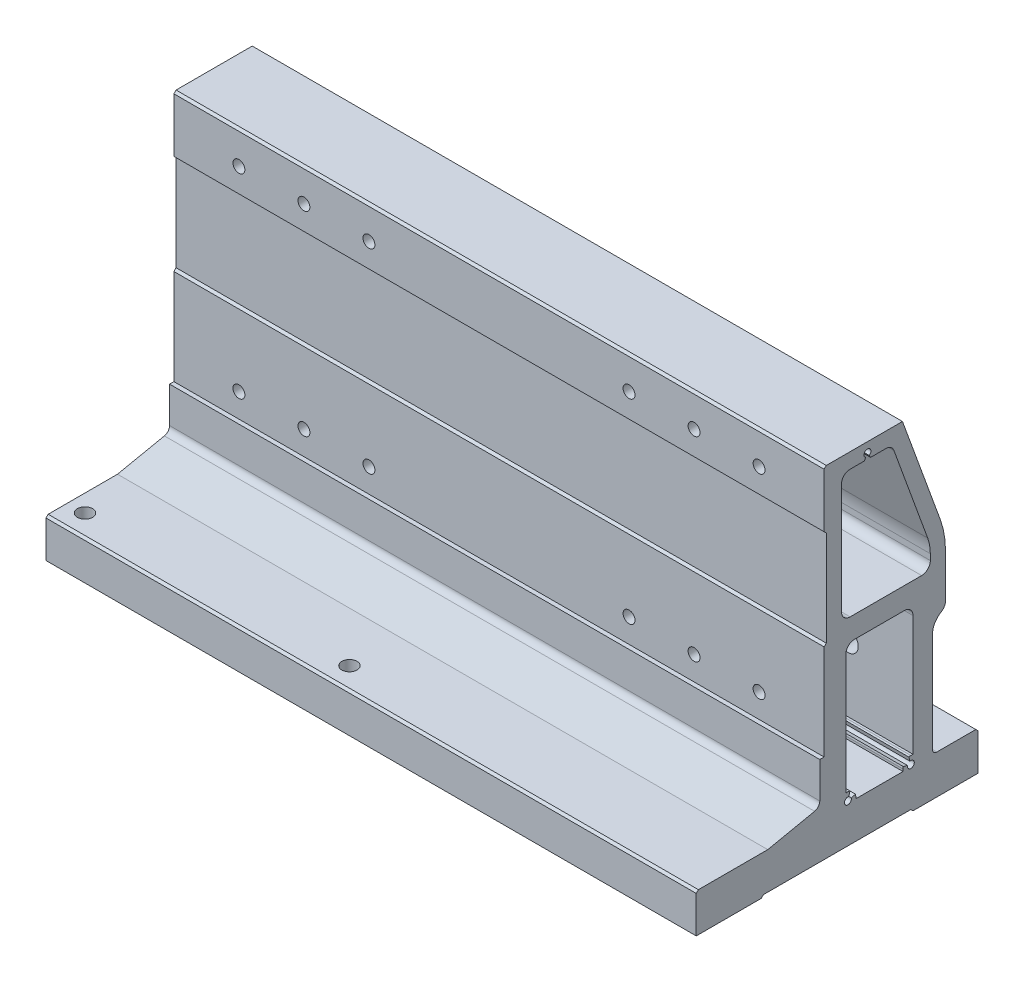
from build123d import *

# Parameters (mm, degrees)
EXTRUDE_1_DEPTH                = 150
HOLE_WIZARD_M5_1_D             = 5.5
HOLE_WIZARD_M5_1_CBORE_D       = 9.5
HOLE_WIZARD_M5_1_CBORE_DEPTH   = 49
PATTERN_LINEAR_1_COUNT         = 2
PATTERN_LINEAR_1_PITCH         = 180
HOLE_WIZARD_M5_1_2_D           = 4.2
HOLE_WIZARD_M5_1_2_DEPTH       = 12
HOLE_WIZARD_M5_1_2_CSINK_D     = 5.05
HOLE_WIZARD_M5_1_2_CSINK_ANGLE = 90
HOLE_WIZARD_M5_1_2_TIP         = 1.2618073
F_5_0MM_1_D                    = 5
F_5_0MM_1_DEPTH                = 10
F_5_0MM_1_TIP                  = 1.502151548
HOLE_WIZARD_7_0_7_1_D          = 7


with BuildPart() as part:
    # Sketch 1 → Extrude 1 (new, symmetric)
    with BuildSketch(Plane(origin=(0, 0, 0), x_dir=(0, 0, -1), z_dir=(1, 0, 0))):
        with BuildLine():
            Line((-5, 156.999997), (-6, 155.999997))
            Line((-6, 155.999997), (-6, 131))
            Line((-6, 131), (-5, 130))
            Line((-5, 130), (-5, 86))
            Line((-5, 86), (-6, 85))
            Line((-6, 85), (-6, 40.999831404))
            Line((-6, 40.999831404), (-8, 40.999831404))
            Line((-8, 40.999831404), (-8, 24.439412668))
            ThreePointArc((-8, 24.439412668), (-8.672384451, 22.546741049), (-10.388137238, 21.502471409))
            Line((-10.388137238, 21.502471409), (-32, 17))
            Line((-32, 17), (-64, 17))
            Line((-64, 17), (-65, 16))
            Line((-65, 16), (-65, -1))
            Line((-65, -1), (-35, -1))
            Line((-35, -1), (-34, 0))
            Line((-34, 0), (34, 0))
            Line((34, 0), (35, -1))
            Line((35, -1), (65, -1))
            Line((65, -1), (65, 16))
            Line((65, 16), (64, 17))
            Line((64, 17), (46, 17))
            ThreePointArc((46, 17), (44.585786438, 17.585786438), (44, 19))
            Line((44, 19), (44, 65))
            ThreePointArc((44, 65), (45.07179677, 69), (48, 71.92820323))
            ThreePointArc((48, 71.92820323), (49.464101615, 73.392304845), (50, 75.392304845))
            Line((50, 75.392304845), (50, 95.442037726))
            ThreePointArc((50, 95.442037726), (49.391487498, 102.392628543), (47.584464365, 109.131743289))
            Line((47.584464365, 109.131743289), (30.149007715, 156.999997))
            Line((30.149007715, 156.999997), (-5, 156.999997))
        make_face()
        with BuildLine():
            Line((2, 146), (2, 95))
            ThreePointArc((2, 95), (3.171572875, 92.171572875), (6, 91))
            Line((6, 91), (39, 91))
            ThreePointArc((39, 91), (41.828427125, 92.171572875), (43, 95))
            Line((43, 95), (43, 97.735875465))
            ThreePointArc((43, 97.735875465), (42.695743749, 101.211170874), (41.792232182, 104.580728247))
            Line((41.792232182, 104.580728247), (26.207110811, 147.368970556))
            ThreePointArc((26.207110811, 147.368970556), (24.742582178, 149.276879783), (22.448664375, 150))
            Line((22.448664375, 150), (15.443373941, 150))
            Line((15.443373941, 150), (14.8, 151.114356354))
            ThreePointArc((14.8, 151.114356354), (14, 154.099997), (13.2, 151.114356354))
            Line((13.2, 151.114356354), (12.556626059, 150))
            Line((12.556626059, 150), (6, 150))
            ThreePointArc((6, 150), (3.171572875, 148.828427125), (2, 146))
        make_face(mode=Mode.SUBTRACT)
        with BuildLine():
            Line((8, 81), (31, 81))
            ThreePointArc((31, 81), (33.828427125, 79.828427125), (35, 77))
            Line((35, 77), (35, 21.6))
            Line((35, 21.6), (34, 21.6))
            ThreePointArc((34, 21.6), (33.530105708, 21.569201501), (33.068251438, 21.477332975))
            Line((33.068251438, 21.477332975), (33.585889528, 19.545481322))
            ThreePointArc((33.585889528, 19.545481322), (35.13137085, 16.86862915), (32.454518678, 18.414110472))
            Line((32.454518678, 18.414110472), (30.522667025, 18.931748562))
            ThreePointArc((30.522667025, 18.931748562), (30.430798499, 18.469894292), (30.4, 18))
            Line((30.4, 18), (30.4, 17))
            Line((30.4, 17), (8.6, 17))
            Line((8.6, 17), (8.6, 18))
            ThreePointArc((8.6, 18), (8.569201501, 18.469894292), (8.477332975, 18.931748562))
            Line((8.477332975, 18.931748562), (6.545481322, 18.414110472))
            ThreePointArc((6.545481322, 18.414110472), (3.86862915, 16.86862915), (5.414110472, 19.545481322))
            Line((5.414110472, 19.545481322), (5.931748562, 21.477332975))
            ThreePointArc((5.931748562, 21.477332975), (5.469894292, 21.569201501), (5, 21.6))
            Line((5, 21.6), (4, 21.6))
            Line((4, 21.6), (4, 77))
            ThreePointArc((4, 77), (5.171572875, 79.828427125), (8, 81))
        make_face(mode=Mode.SUBTRACT)
    extrude(amount=EXTRUDE_1_DEPTH, both=True)

    # Hole Wizard M5 _ _ _ _ _1 (through all)
    with Locations(Plane(origin=(0, 0, -50), x_dir=(-1, 0, 0), z_dir=(0, 0, -1))):
        with Locations((-120, 142), (-90, 142), (-60, 142), (-120, 52), (-90, 52), (-60, 52)):
            hole_wizard_m5_1 = CounterBoreHole(HOLE_WIZARD_M5_1_D / 2, HOLE_WIZARD_M5_1_CBORE_D / 2, HOLE_WIZARD_M5_1_CBORE_DEPTH)

    # Pattern Linear 1: Hole Wizard M5 _ _ _ _ _1 ×2
    with Locations(*[(-i * PATTERN_LINEAR_1_PITCH, 0, 0) for i in range(1, PATTERN_LINEAR_1_COUNT)]):
        add(hole_wizard_m5_1, mode=Mode.SUBTRACT)

    # Hole Wizard M5 _ _1 2
    with Locations(Plane.ZY.offset(150)):
        with Locations((-45, 8), (-9, 8)):
            CounterSinkHole(HOLE_WIZARD_M5_1_2_D / 2, HOLE_WIZARD_M5_1_2_CSINK_D / 2, depth=HOLE_WIZARD_M5_1_2_DEPTH, counter_sink_angle=HOLE_WIZARD_M5_1_2_CSINK_ANGLE)
            with Locations((0, 0, -(HOLE_WIZARD_M5_1_2_DEPTH + HOLE_WIZARD_M5_1_2_TIP / 2))):  # 118° drill point
                Cone(0, HOLE_WIZARD_M5_1_2_D / 2, HOLE_WIZARD_M5_1_2_TIP, mode=Mode.SUBTRACT)

    # 5.0mm _ _1
    with Locations(Plane(origin=(0, 0, 0), x_dir=(-1, 0, 0), z_dir=(0, -1, 0))):
        with Locations((20, 0), (142, 0)):
            Hole(F_5_0MM_1_D / 2, depth=F_5_0MM_1_DEPTH)
            with Locations((0, 0, -(F_5_0MM_1_DEPTH + F_5_0MM_1_TIP / 2))):  # 118° drill point
                Cone(0, F_5_0MM_1_D / 2, F_5_0MM_1_TIP, mode=Mode.SUBTRACT)

    # Hole Wizard 7.0 _7_ _ _1 (through all)
    with Locations(Plane(origin=(0, -1, 0), x_dir=(-1, 0, 0), z_dir=(0, -1, 0))):
        with Locations((142, -55), (20, -55), (142, 55), (20, 55)):
            Hole(HOLE_WIZARD_7_0_7_1_D / 2)


solid = part.part
